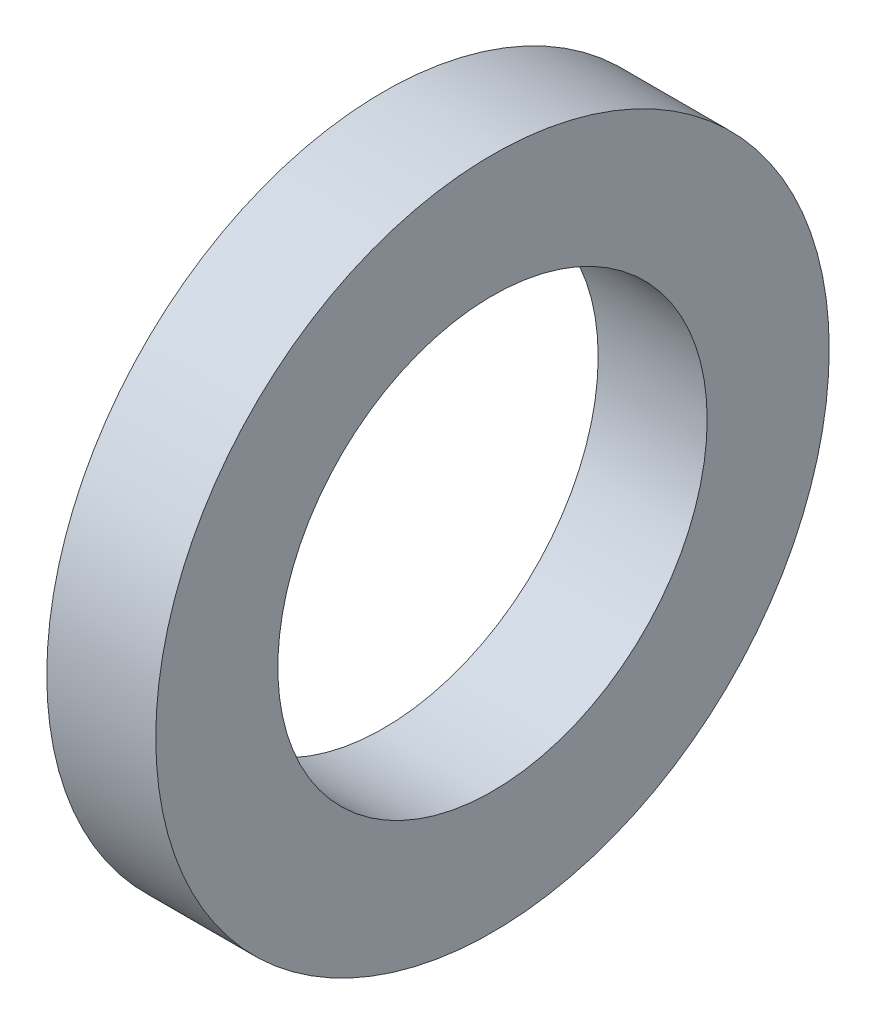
from build123d import *

# Parameters (mm, degrees)
SKETCH1_R      = 19.6215
SKETCH1_R_2    = 12.5095
EXTRUDE1_DEPTH = 6.35


with BuildPart() as part:
    # Sketch1 → Extrude1 (new body)
    with BuildSketch(Plane(origin=(0, 0, 0), x_dir=(0, 0, -1), z_dir=(1, 0, 0))):
        Circle(SKETCH1_R)
        Circle(SKETCH1_R_2, mode=Mode.SUBTRACT)
    extrude(amount=EXTRUDE1_DEPTH)


solid = part.part
